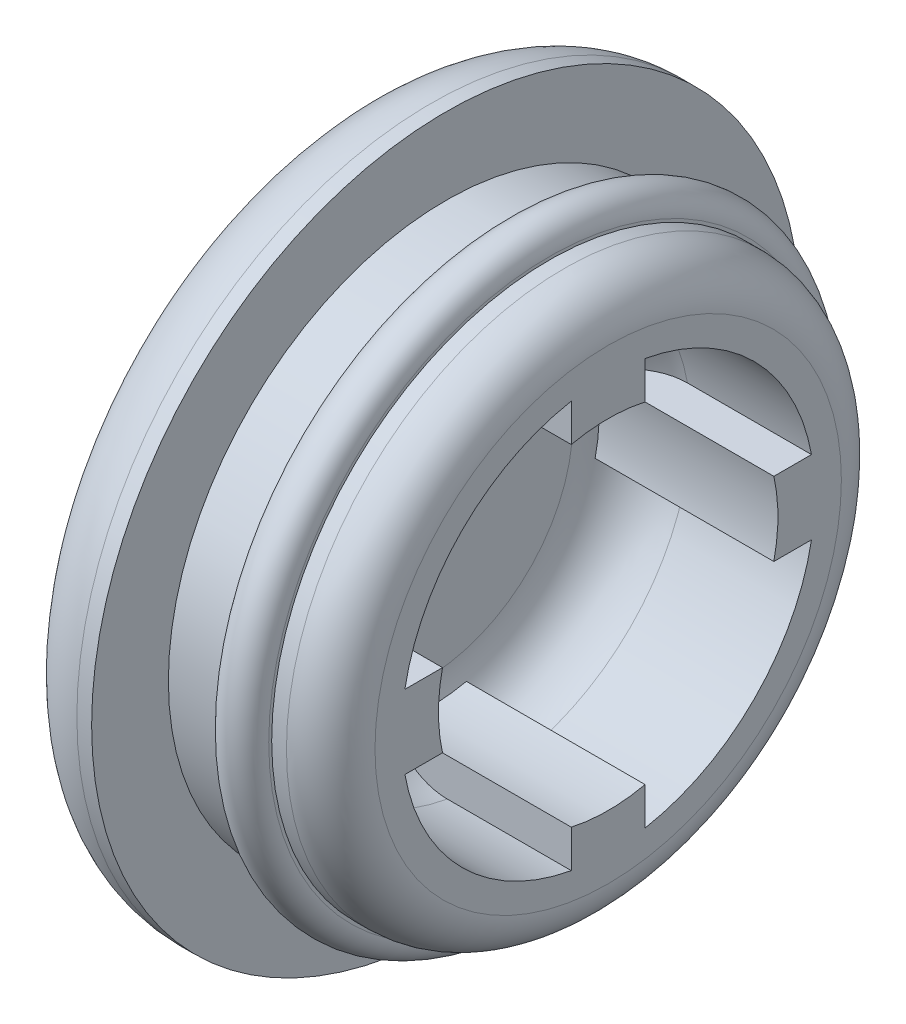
from build123d import *

# Parameters (mm, degrees)
EXTRUSION1_REACH = 20.98


with BuildPart() as part:
    # Esquisse1 → R_volution1 (revolve)
    with BuildSketch(Plane.XY, mode=Mode.PRIVATE) as r_volution1_sk:
        with BuildLine():
            Line((0, 0), (0, 9.5))
            ThreePointArc((0, 9.5), (0.732233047, 11.267766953), (2.5, 12))
            Line((2.5, 12), (3, 12))
            Line((3, 12), (3, 9.4))
            Line((3, 9.4), (5, 9.4))
            Line((5, 9.4), (5, 9.5))
            ThreePointArc((5, 9.5), (5.75, 10.25), (6.5, 9.5))
            Line((6.5, 9.5), (6.5, 9.4))
            Line((6.5, 9.4), (7, 9.4))
            ThreePointArc((7, 9.4), (8.060660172, 8.960660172), (8.5, 7.9))
            Line((8.5, 7.9), (8.5, 7))
            Line((8.5, 7), (4.3, 7))
            ThreePointArc((4.3, 7), (2.885786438, 6.414213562), (2.3, 5))
            Line((2.3, 5), (2.3, 0))
            Line((2.3, 0), (0, 0))
        make_face()
    revolve(r_volution1_sk.sketch.rotate(Axis((0, 0, 0), (1, 0, 0)), 90), axis=Axis((0, 0, 0), (1, 0, 0)))

    # Esquisse2 → Extrusion1 (add, up to next)
    with BuildSketch(Plane(origin=(8.5, 0, 0), x_dir=(0, 0, -1), z_dir=(1, 0, 0)), mode=Mode.PRIVATE) as extrusion1_sk1:
        with BuildLine():
            ThreePointArc((1.25, 6.887488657), (0, 7), (-1.25, 6.887488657))
            Line((-1.25, 6.887488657), (-1.25, 5.61248608))
            ThreePointArc((-1.25, 5.61248608), (0, 5.75), (1.25, 5.61248608))
            Line((1.25, 5.61248608), (1.25, 6.887488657))
        make_face()
    extrusion1_tool1 = extrude(extrusion1_sk1.sketch, amount=-EXTRUSION1_REACH, mode=Mode.PRIVATE) - part.part
    # Esquisse2 → Extrusion1 (add, up to next)
    with BuildSketch(Plane(origin=(8.5, 0, 0), x_dir=(0, 0, -1), z_dir=(1, 0, 0)), mode=Mode.PRIVATE) as extrusion1_sk2:
        with BuildLine():
            Line((-5.61248608, 1.25), (-6.887488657, 1.25))
            ThreePointArc((-6.887488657, 1.25), (-7, 0), (-6.887488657, -1.25))
            Line((-6.887488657, -1.25), (-5.61248608, -1.25))
            ThreePointArc((-5.61248608, -1.25), (-5.75, 0), (-5.61248608, 1.25))
        make_face()
    extrusion1_tool2 = extrude(extrusion1_sk2.sketch, amount=-EXTRUSION1_REACH, mode=Mode.PRIVATE) - part.part
    # Esquisse2 → Extrusion1 (add, up to next)
    with BuildSketch(Plane(origin=(8.5, 0, 0), x_dir=(0, 0, -1), z_dir=(1, 0, 0)), mode=Mode.PRIVATE) as extrusion1_sk3:
        with BuildLine():
            Line((1.25, -6.887488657), (1.25, -5.61248608))
            ThreePointArc((1.25, -5.61248608), (0, -5.75), (-1.25, -5.61248608))
            Line((-1.25, -5.61248608), (-1.25, -6.887488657))
            ThreePointArc((-1.25, -6.887488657), (0, -7), (1.25, -6.887488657))
        make_face()
    extrusion1_tool3 = extrude(extrusion1_sk3.sketch, amount=-EXTRUSION1_REACH, mode=Mode.PRIVATE) - part.part
    # Esquisse2 → Extrusion1 (add, up to next)
    with BuildSketch(Plane(origin=(8.5, 0, 0), x_dir=(0, 0, -1), z_dir=(1, 0, 0)), mode=Mode.PRIVATE) as extrusion1_sk4:
        with BuildLine():
            Line((6.887488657, 1.25), (5.61248608, 1.25))
            ThreePointArc((5.61248608, 1.25), (5.75, 0), (5.61248608, -1.25))
            Line((5.61248608, -1.25), (6.887488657, -1.25))
            ThreePointArc((6.887488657, -1.25), (7, 0), (6.887488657, 1.25))
        make_face()
    extrusion1_tool4 = extrude(extrusion1_sk4.sketch, amount=-EXTRUSION1_REACH, mode=Mode.PRIVATE) - part.part
    add(extrusion1_tool1.solids().sort_by_distance((8.5, 6.333281, 0))[0])
    add(extrusion1_tool2.solids().sort_by_distance((8.5, 0, 6.333281))[0])
    add(extrusion1_tool3.solids().sort_by_distance((8.5, -6.333281, 0))[0])
    add(extrusion1_tool4.solids().sort_by_distance((8.5, 0, -6.333281))[0])


solid = part.part
